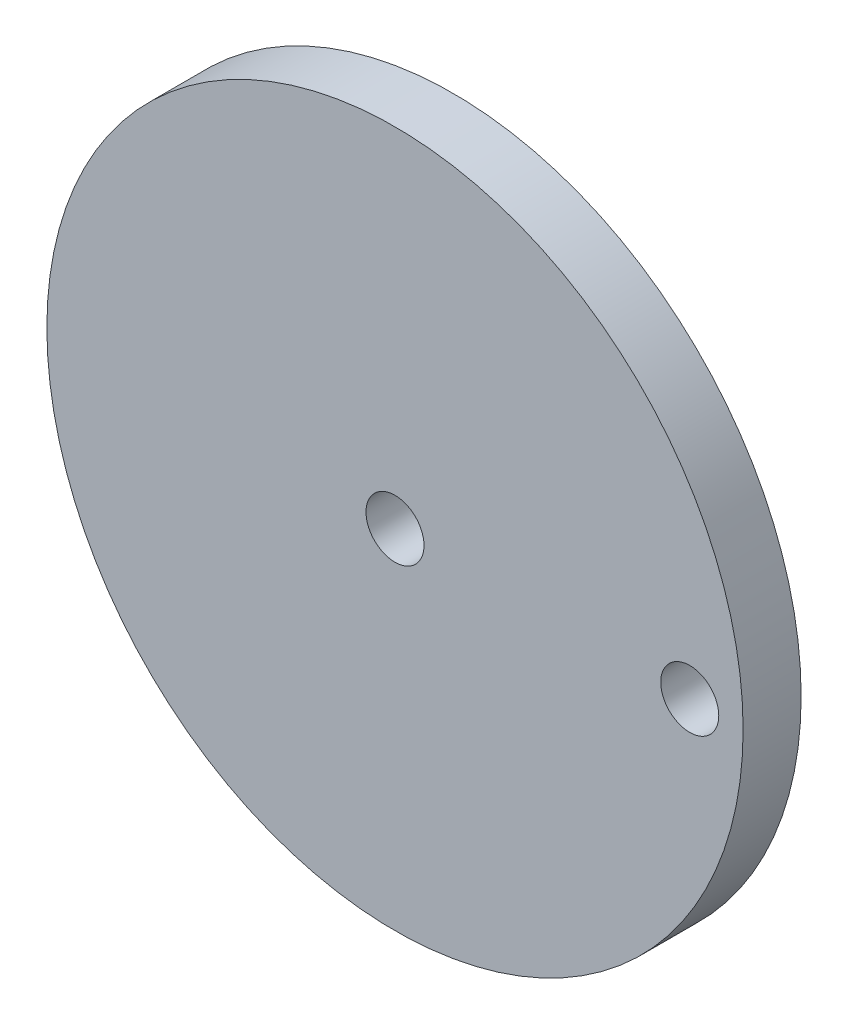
from build123d import *

# Parameters (mm, degrees)
SKETCH1_R           = 30
SKETCH1_R_2         = 2.5
BOSS_EXTRUDE2_DEPTH = 5


with BuildPart() as part:
    # Sketch1 → Boss-Extrude2 (new body)
    with BuildSketch(Plane.XY):
        Circle(SKETCH1_R)
        with Locations((25.4, 0)):
            Circle(SKETCH1_R_2, mode=Mode.SUBTRACT)
        Circle(SKETCH1_R_2, mode=Mode.SUBTRACT)
    extrude(amount=BOSS_EXTRUDE2_DEPTH)


solid = part.part
